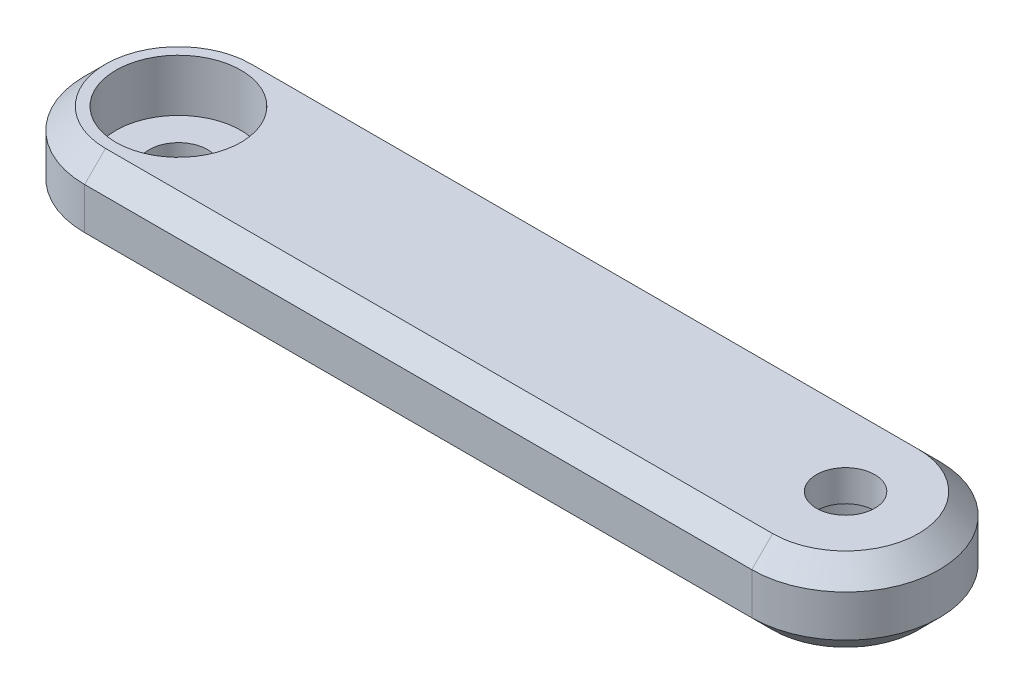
ISO-10303-21;
HEADER;
FILE_DESCRIPTION(('STEP AP214'),'2;1');
FILE_NAME('part.step','',(''),(''),'','','');
FILE_SCHEMA(('AUTOMOTIVE_DESIGN { 1 0 10303 214 1 1 1 1 }'));
ENDSEC;
DATA;
#1=APPLICATION_CONTEXT('core data for automotive mechanical design processes');
#2=APPLICATION_PROTOCOL_DEFINITION('international standard','automotive_design',2000,#1);
#3=PRODUCT_CONTEXT('',#1,'mechanical');
#4=PRODUCT('Part','Part','',(#3));
#5=PRODUCT_RELATED_PRODUCT_CATEGORY('part','',(#4));
#6=PRODUCT_DEFINITION_FORMATION('','',#4);
#7=PRODUCT_DEFINITION_CONTEXT('part definition',#1,'design');
#8=PRODUCT_DEFINITION('design','',#6,#7);
#9=PRODUCT_DEFINITION_SHAPE('','',#8);
#10=(LENGTH_UNIT() NAMED_UNIT(*) SI_UNIT(.MILLI.,.METRE.));
#11=(NAMED_UNIT(*) PLANE_ANGLE_UNIT() SI_UNIT($,.RADIAN.));
#12=(NAMED_UNIT(*) SI_UNIT($,.STERADIAN.) SOLID_ANGLE_UNIT());
#13=UNCERTAINTY_MEASURE_WITH_UNIT(LENGTH_MEASURE(1.E-05),#10,'distance_accuracy_value','');
#14=(GEOMETRIC_REPRESENTATION_CONTEXT(3) GLOBAL_UNCERTAINTY_ASSIGNED_CONTEXT((#13)) GLOBAL_UNIT_ASSIGNED_CONTEXT((#10,
#11,#12)) REPRESENTATION_CONTEXT('',''));
#15=CARTESIAN_POINT('',(0.,0.,0.));
#16=DIRECTION('',(0.,0.,1.));
#17=DIRECTION('',(1.,0.,0.));
#18=AXIS2_PLACEMENT_3D('',#15,#16,#17);
#19=CARTESIAN_POINT('',(-15.6632860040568,-6.,-1.3052738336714));
#20=DIRECTION('',(0.,1.,0.));
#21=DIRECTION('',(0.,0.,1.));
#22=AXIS2_PLACEMENT_3D('',#19,#20,#21);
#23=CYLINDRICAL_SURFACE('',#22,1.4);
#24=CARTESIAN_POINT('',(-15.6632860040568,0.,-1.3052738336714));
#25=DIRECTION('',(0.,1.,0.));
#26=DIRECTION('',(0.,0.,1.));
#27=AXIS2_PLACEMENT_3D('',#24,#25,#26);
#28=CIRCLE('',#27,1.4);
#29=CARTESIAN_POINT('',(-15.6632860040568,0.,0.0947261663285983));
#30=VERTEX_POINT('',#29);
#31=EDGE_CURVE('E171',#30,#30,#28,.T.);
#32=ORIENTED_EDGE('',*,*,#31,.F.);
#33=EDGE_LOOP('',(#32));
#34=FACE_BOUND('',#33,.T.);
#35=CARTESIAN_POINT('',(-15.6632860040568,1.5,-1.3052738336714));
#36=DIRECTION('',(0.,1.,0.));
#37=DIRECTION('',(0.,0.,1.));
#38=AXIS2_PLACEMENT_3D('',#35,#36,#37);
#39=CIRCLE('',#38,1.4);
#40=CARTESIAN_POINT('',(-15.6632860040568,1.5,0.0947261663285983));
#41=VERTEX_POINT('',#40);
#42=EDGE_CURVE('E48',#41,#41,#39,.F.);
#43=ORIENTED_EDGE('',*,*,#42,.F.);
#44=EDGE_LOOP('',(#43));
#45=FACE_BOUND('',#44,.T.);
#46=ADVANCED_FACE('F43',(#34,#45),#23,.F.);
#47=CARTESIAN_POINT('',(16.3367139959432,-6.,-1.3052738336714));
#48=DIRECTION('',(0.,1.,0.));
#49=DIRECTION('',(0.,0.,1.));
#50=AXIS2_PLACEMENT_3D('',#47,#48,#49);
#51=CYLINDRICAL_SURFACE('',#50,1.4);
#52=CARTESIAN_POINT('',(16.3367139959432,4.,-1.3052738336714));
#53=DIRECTION('',(0.,-1.,0.));
#54=DIRECTION('',(0.,0.,-1.));
#55=AXIS2_PLACEMENT_3D('',#52,#53,#54);
#56=CIRCLE('',#55,1.4);
#57=CARTESIAN_POINT('',(16.3367139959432,4.,-2.7052738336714));
#58=VERTEX_POINT('',#57);
#59=EDGE_CURVE('E139',#58,#58,#56,.T.);
#60=ORIENTED_EDGE('',*,*,#59,.F.);
#61=EDGE_LOOP('',(#60));
#62=FACE_BOUND('',#61,.T.);
#63=CARTESIAN_POINT('',(16.3367139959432,2.5,-1.3052738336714));
#64=DIRECTION('',(0.,-1.,0.));
#65=DIRECTION('',(0.,0.,-1.));
#66=AXIS2_PLACEMENT_3D('',#63,#64,#65);
#67=CIRCLE('',#66,1.4);
#68=CARTESIAN_POINT('',(16.3367139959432,2.5,-2.7052738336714));
#69=VERTEX_POINT('',#68);
#70=EDGE_CURVE('E147',#69,#69,#67,.T.);
#71=ORIENTED_EDGE('',*,*,#70,.T.);
#72=EDGE_LOOP('',(#71));
#73=FACE_BOUND('',#72,.T.);
#74=ADVANCED_FACE('F247',(#62,#73),#51,.F.);
#75=CARTESIAN_POINT('',(-15.6632860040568,4.,-1.3052738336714));
#76=DIRECTION('',(0.,1.,0.));
#77=DIRECTION('',(0.,0.,1.));
#78=AXIS2_PLACEMENT_3D('',#75,#76,#77);
#79=PLANE('',#78);
#80=CARTESIAN_POINT('',(-15.6632860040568,4.,-1.3052738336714));
#81=DIRECTION('',(0.,1.,0.));
#82=DIRECTION('',(0.,0.,1.));
#83=AXIS2_PLACEMENT_3D('',#80,#81,#82);
#84=CIRCLE('',#83,3.);
#85=CARTESIAN_POINT('',(-15.6632860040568,4.,1.6947261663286));
#86=VERTEX_POINT('',#85);
#87=EDGE_CURVE('E166',#86,#86,#84,.T.);
#88=ORIENTED_EDGE('',*,*,#87,.F.);
#89=EDGE_LOOP('',(#88));
#90=FACE_BOUND('',#89,.T.);
#91=DIRECTION('',(1.,0.,0.));
#92=VECTOR('',#91,1.);
#93=CARTESIAN_POINT('',(16.3367139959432,4.,2.19472616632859));
#94=LINE('',#93,#92);
#95=CARTESIAN_POINT('',(-15.6632860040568,4.,2.19472616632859));
#96=VERTEX_POINT('',#95);
#97=CARTESIAN_POINT('',(16.3367139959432,4.,2.19472616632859));
#98=VERTEX_POINT('',#97);
#99=EDGE_CURVE('E122',#96,#98,#94,.T.);
#100=ORIENTED_EDGE('',*,*,#99,.T.);
#101=CARTESIAN_POINT('',(16.3367139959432,4.,-1.3052738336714));
#102=DIRECTION('',(0.,1.,0.));
#103=DIRECTION('',(0.,0.,1.));
#104=AXIS2_PLACEMENT_3D('',#101,#102,#103);
#105=CIRCLE('',#104,3.5);
#106=CARTESIAN_POINT('',(16.3367139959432,4.,-4.8052738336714));
#107=VERTEX_POINT('',#106);
#108=EDGE_CURVE('E118',#98,#107,#105,.T.);
#109=ORIENTED_EDGE('',*,*,#108,.T.);
#110=DIRECTION('',(-1.,0.,0.));
#111=VECTOR('',#110,1.);
#112=CARTESIAN_POINT('',(-15.6632860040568,4.,-4.8052738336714));
#113=LINE('',#112,#111);
#114=CARTESIAN_POINT('',(-15.6632860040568,4.,-4.8052738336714));
#115=VERTEX_POINT('',#114);
#116=EDGE_CURVE('E111',#107,#115,#113,.T.);
#117=ORIENTED_EDGE('',*,*,#116,.T.);
#118=CARTESIAN_POINT('',(-15.6632860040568,4.,-1.3052738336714));
#119=DIRECTION('',(0.,1.,0.));
#120=DIRECTION('',(0.,0.,1.));
#121=AXIS2_PLACEMENT_3D('',#118,#119,#120);
#122=CIRCLE('',#121,3.5);
#123=EDGE_CURVE('E115',#115,#96,#122,.T.);
#124=ORIENTED_EDGE('',*,*,#123,.T.);
#125=EDGE_LOOP('',(#100,#109,#117,#124));
#126=FACE_BOUND('',#125,.T.);
#127=ORIENTED_EDGE('',*,*,#59,.T.);
#128=EDGE_LOOP('',(#127));
#129=FACE_BOUND('',#128,.T.);
#130=ADVANCED_FACE('F113',(#90,#126,#129),#79,.T.);
#131=CARTESIAN_POINT('',(-15.6632860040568,0.,-1.3052738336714));
#132=DIRECTION('',(0.,1.,0.));
#133=DIRECTION('',(0.,0.,1.));
#134=AXIS2_PLACEMENT_3D('',#131,#132,#133);
#135=PLANE('',#134);
#136=CARTESIAN_POINT('',(16.3367139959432,0.,-1.3052738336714));
#137=DIRECTION('',(0.,-1.,0.));
#138=DIRECTION('',(0.,0.,-1.));
#139=AXIS2_PLACEMENT_3D('',#136,#137,#138);
#140=CIRCLE('',#139,3.);
#141=CARTESIAN_POINT('',(16.3367139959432,0.,-4.30527383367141));
#142=VERTEX_POINT('',#141);
#143=EDGE_CURVE('E159',#142,#142,#140,.T.);
#144=ORIENTED_EDGE('',*,*,#143,.F.);
#145=EDGE_LOOP('',(#144));
#146=FACE_BOUND('',#145,.T.);
#147=DIRECTION('',(1.,0.,0.));
#148=VECTOR('',#147,1.);
#149=CARTESIAN_POINT('',(-15.6632860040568,0.,-4.80527383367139));
#150=LINE('',#149,#148);
#151=CARTESIAN_POINT('',(-15.6632860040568,0.,-4.80527383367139));
#152=VERTEX_POINT('',#151);
#153=CARTESIAN_POINT('',(16.3367139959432,0.,-4.80527383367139));
#154=VERTEX_POINT('',#153);
#155=EDGE_CURVE('E204',#152,#154,#150,.T.);
#156=ORIENTED_EDGE('',*,*,#155,.T.);
#157=CARTESIAN_POINT('',(16.3367139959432,0.,-1.3052738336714));
#158=DIRECTION('',(0.,1.,0.));
#159=DIRECTION('',(0.,0.,1.));
#160=AXIS2_PLACEMENT_3D('',#157,#158,#159);
#161=CIRCLE('',#160,3.49999999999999);
#162=CARTESIAN_POINT('',(16.3367139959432,0.,2.19472616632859));
#163=VERTEX_POINT('',#162);
#164=EDGE_CURVE('E11',#154,#163,#161,.F.);
#165=ORIENTED_EDGE('',*,*,#164,.T.);
#166=DIRECTION('',(-1.,0.,0.));
#167=VECTOR('',#166,1.);
#168=CARTESIAN_POINT('',(-15.6632860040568,0.,2.19472616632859));
#169=LINE('',#168,#167);
#170=CARTESIAN_POINT('',(-15.6632860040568,0.,2.19472616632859));
#171=VERTEX_POINT('',#170);
#172=EDGE_CURVE('E53',#163,#171,#169,.T.);
#173=ORIENTED_EDGE('',*,*,#172,.T.);
#174=CARTESIAN_POINT('',(-15.6632860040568,0.,-1.3052738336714));
#175=DIRECTION('',(0.,1.,0.));
#176=DIRECTION('',(0.,0.,1.));
#177=AXIS2_PLACEMENT_3D('',#174,#175,#176);
#178=CIRCLE('',#177,3.49999999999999);
#179=EDGE_CURVE('E206',#171,#152,#178,.F.);
#180=ORIENTED_EDGE('',*,*,#179,.T.);
#181=EDGE_LOOP('',(#156,#165,#173,#180));
#182=FACE_BOUND('',#181,.T.);
#183=ORIENTED_EDGE('',*,*,#31,.T.);
#184=EDGE_LOOP('',(#183));
#185=FACE_BOUND('',#184,.T.);
#186=ADVANCED_FACE('F238',(#146,#182,#185),#135,.F.);
#187=CARTESIAN_POINT('',(-15.6632860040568,4.,-1.3052738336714));
#188=DIRECTION('',(0.,-1.,0.));
#189=DIRECTION('',(0.,0.,-1.));
#190=AXIS2_PLACEMENT_3D('',#187,#188,#189);
#191=CYLINDRICAL_SURFACE('',#190,4.5);
#192=DIRECTION('',(0.,-1.,0.));
#193=VECTOR('',#192,1.);
#194=CARTESIAN_POINT('',(-15.6632860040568,4.,3.1947261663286));
#195=LINE('',#194,#193);
#196=CARTESIAN_POINT('',(-15.6632860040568,2.99999999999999,3.1947261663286));
#197=VERTEX_POINT('',#196);
#198=CARTESIAN_POINT('',(-15.6632860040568,1.,3.1947261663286));
#199=VERTEX_POINT('',#198);
#200=EDGE_CURVE('E133',#197,#199,#195,.T.);
#201=ORIENTED_EDGE('',*,*,#200,.F.);
#202=CARTESIAN_POINT('',(-15.6632860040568,2.99999999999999,-1.3052738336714));
#203=DIRECTION('',(0.,1.,0.));
#204=DIRECTION('',(0.,0.,1.));
#205=AXIS2_PLACEMENT_3D('',#202,#203,#204);
#206=CIRCLE('',#205,4.5);
#207=CARTESIAN_POINT('',(-15.6632860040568,2.99999999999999,-5.8052738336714));
#208=VERTEX_POINT('',#207);
#209=EDGE_CURVE('E202',#197,#208,#206,.F.);
#210=ORIENTED_EDGE('',*,*,#209,.T.);
#211=DIRECTION('',(0.,-1.,0.));
#212=VECTOR('',#211,1.);
#213=CARTESIAN_POINT('',(-15.6632860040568,4.,-5.8052738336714));
#214=LINE('',#213,#212);
#215=CARTESIAN_POINT('',(-15.6632860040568,1.,-5.8052738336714));
#216=VERTEX_POINT('',#215);
#217=EDGE_CURVE('E172',#208,#216,#214,.T.);
#218=ORIENTED_EDGE('',*,*,#217,.T.);
#219=CARTESIAN_POINT('',(-15.6632860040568,1.,-1.3052738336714));
#220=DIRECTION('',(0.,1.,0.));
#221=DIRECTION('',(0.,0.,1.));
#222=AXIS2_PLACEMENT_3D('',#219,#220,#221);
#223=CIRCLE('',#222,4.5);
#224=EDGE_CURVE('E200',#216,#199,#223,.T.);
#225=ORIENTED_EDGE('',*,*,#224,.T.);
#226=EDGE_LOOP('',(#201,#210,#218,#225));
#227=FACE_BOUND('',#226,.T.);
#228=ADVANCED_FACE('F232',(#227),#191,.T.);
#229=CARTESIAN_POINT('',(11.3367139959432,4.,3.1947261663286));
#230=DIRECTION('',(0.,0.,-1.));
#231=DIRECTION('',(-1.,0.,0.));
#232=AXIS2_PLACEMENT_3D('',#229,#230,#231);
#233=PLANE('',#232);
#234=DIRECTION('',(0.,-1.,0.));
#235=VECTOR('',#234,1.);
#236=CARTESIAN_POINT('',(16.3367139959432,4.,3.1947261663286));
#237=LINE('',#236,#235);
#238=CARTESIAN_POINT('',(16.3367139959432,2.99999999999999,3.1947261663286));
#239=VERTEX_POINT('',#238);
#240=CARTESIAN_POINT('',(16.3367139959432,1.,3.1947261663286));
#241=VERTEX_POINT('',#240);
#242=EDGE_CURVE('E178',#239,#241,#237,.T.);
#243=ORIENTED_EDGE('',*,*,#242,.F.);
#244=DIRECTION('',(-1.,0.,0.));
#245=VECTOR('',#244,1.);
#246=CARTESIAN_POINT('',(-15.6632860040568,2.99999999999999,3.1947261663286));
#247=LINE('',#246,#245);
#248=EDGE_CURVE('E195',#239,#197,#247,.T.);
#249=ORIENTED_EDGE('',*,*,#248,.T.);
#250=ORIENTED_EDGE('',*,*,#200,.T.);
#251=DIRECTION('',(1.,0.,0.));
#252=VECTOR('',#251,1.);
#253=CARTESIAN_POINT('',(11.3367139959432,1.,3.1947261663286));
#254=LINE('',#253,#252);
#255=EDGE_CURVE('E193',#199,#241,#254,.T.);
#256=ORIENTED_EDGE('',*,*,#255,.T.);
#257=EDGE_LOOP('',(#243,#249,#250,#256));
#258=FACE_BOUND('',#257,.T.);
#259=ADVANCED_FACE('F218',(#258),#233,.F.);
#260=CARTESIAN_POINT('',(16.3367139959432,4.,-1.3052738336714));
#261=DIRECTION('',(0.,-1.,0.));
#262=DIRECTION('',(0.,0.,-1.));
#263=AXIS2_PLACEMENT_3D('',#260,#261,#262);
#264=CYLINDRICAL_SURFACE('',#263,4.5);
#265=DIRECTION('',(0.,-1.,0.));
#266=VECTOR('',#265,1.);
#267=CARTESIAN_POINT('',(16.3367139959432,4.,-5.8052738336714));
#268=LINE('',#267,#266);
#269=CARTESIAN_POINT('',(16.3367139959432,2.99999999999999,-5.8052738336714));
#270=VERTEX_POINT('',#269);
#271=CARTESIAN_POINT('',(16.3367139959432,1.,-5.8052738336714));
#272=VERTEX_POINT('',#271);
#273=EDGE_CURVE('E175',#270,#272,#268,.T.);
#274=ORIENTED_EDGE('',*,*,#273,.F.);
#275=CARTESIAN_POINT('',(16.3367139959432,2.99999999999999,-1.3052738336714));
#276=DIRECTION('',(0.,1.,0.));
#277=DIRECTION('',(0.,0.,1.));
#278=AXIS2_PLACEMENT_3D('',#275,#276,#277);
#279=CIRCLE('',#278,4.5);
#280=EDGE_CURVE('E190',#270,#239,#279,.F.);
#281=ORIENTED_EDGE('',*,*,#280,.T.);
#282=ORIENTED_EDGE('',*,*,#242,.T.);
#283=CARTESIAN_POINT('',(16.3367139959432,1.,-1.3052738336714));
#284=DIRECTION('',(0.,1.,0.));
#285=DIRECTION('',(0.,0.,1.));
#286=AXIS2_PLACEMENT_3D('',#283,#284,#285);
#287=CIRCLE('',#286,4.5);
#288=EDGE_CURVE('E187',#241,#272,#287,.T.);
#289=ORIENTED_EDGE('',*,*,#288,.T.);
#290=EDGE_LOOP('',(#274,#281,#282,#289));
#291=FACE_BOUND('',#290,.T.);
#292=ADVANCED_FACE('F216',(#291),#264,.T.);
#293=CARTESIAN_POINT('',(-15.6632860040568,4.,-5.8052738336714));
#294=DIRECTION('',(0.,0.,1.));
#295=DIRECTION('',(1.,0.,0.));
#296=AXIS2_PLACEMENT_3D('',#293,#294,#295);
#297=PLANE('',#296);
#298=ORIENTED_EDGE('',*,*,#217,.F.);
#299=DIRECTION('',(1.,0.,0.));
#300=VECTOR('',#299,1.);
#301=CARTESIAN_POINT('',(16.3367139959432,2.99999999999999,-5.8052738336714));
#302=LINE('',#301,#300);
#303=EDGE_CURVE('E136',#208,#270,#302,.T.);
#304=ORIENTED_EDGE('',*,*,#303,.T.);
#305=ORIENTED_EDGE('',*,*,#273,.T.);
#306=DIRECTION('',(-1.,0.,0.));
#307=VECTOR('',#306,1.);
#308=CARTESIAN_POINT('',(-15.6632860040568,1.,-5.8052738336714));
#309=LINE('',#308,#307);
#310=EDGE_CURVE('E197',#272,#216,#309,.T.);
#311=ORIENTED_EDGE('',*,*,#310,.T.);
#312=EDGE_LOOP('',(#298,#304,#305,#311));
#313=FACE_BOUND('',#312,.T.);
#314=ADVANCED_FACE('F229',(#313),#297,.F.);
#315=CARTESIAN_POINT('',(-15.6632860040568,4.,-1.3052738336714));
#316=DIRECTION('',(0.,-1.,0.));
#317=DIRECTION('',(0.,0.,-1.));
#318=AXIS2_PLACEMENT_3D('',#315,#316,#317);
#319=CONICAL_SURFACE('',#318,3.5,0.785398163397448);
#320=DIRECTION('',(0.,0.707106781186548,0.707106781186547));
#321=VECTOR('',#320,1.);
#322=CARTESIAN_POINT('',(-15.6632860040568,2.99999999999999,-5.8052738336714));
#323=LINE('',#322,#321);
#324=EDGE_CURVE('E128',#208,#115,#323,.T.);
#325=ORIENTED_EDGE('',*,*,#324,.F.);
#326=ORIENTED_EDGE('',*,*,#209,.F.);
#327=DIRECTION('',(0.,-0.707106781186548,0.707106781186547));
#328=VECTOR('',#327,1.);
#329=CARTESIAN_POINT('',(-15.6632860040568,4.,2.19472616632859));
#330=LINE('',#329,#328);
#331=EDGE_CURVE('E131',#96,#197,#330,.T.);
#332=ORIENTED_EDGE('',*,*,#331,.F.);
#333=ORIENTED_EDGE('',*,*,#123,.F.);
#334=EDGE_LOOP('',(#325,#326,#332,#333));
#335=FACE_BOUND('',#334,.T.);
#336=ADVANCED_FACE('F126',(#335),#319,.T.);
#337=CARTESIAN_POINT('',(-15.6632860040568,4.,2.19472616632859));
#338=DIRECTION('',(0.,0.707106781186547,0.707106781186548));
#339=DIRECTION('',(-1.,0.,0.));
#340=AXIS2_PLACEMENT_3D('',#337,#338,#339);
#341=PLANE('',#340);
#342=ORIENTED_EDGE('',*,*,#331,.T.);
#343=ORIENTED_EDGE('',*,*,#248,.F.);
#344=DIRECTION('',(0.,-0.707106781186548,0.707106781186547));
#345=VECTOR('',#344,1.);
#346=CARTESIAN_POINT('',(16.3367139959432,4.,2.19472616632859));
#347=LINE('',#346,#345);
#348=EDGE_CURVE('E137',#98,#239,#347,.T.);
#349=ORIENTED_EDGE('',*,*,#348,.F.);
#350=ORIENTED_EDGE('',*,*,#99,.F.);
#351=EDGE_LOOP('',(#342,#343,#349,#350));
#352=FACE_BOUND('',#351,.T.);
#353=ADVANCED_FACE('F289',(#352),#341,.T.);
#354=CARTESIAN_POINT('',(-15.6632860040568,4.,-4.8052738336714));
#355=DIRECTION('',(0.,0.707106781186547,-0.707106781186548));
#356=DIRECTION('',(1.,0.,0.));
#357=AXIS2_PLACEMENT_3D('',#354,#355,#356);
#358=PLANE('',#357);
#359=ORIENTED_EDGE('',*,*,#324,.T.);
#360=ORIENTED_EDGE('',*,*,#116,.F.);
#361=DIRECTION('',(0.,0.707106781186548,0.707106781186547));
#362=VECTOR('',#361,1.);
#363=CARTESIAN_POINT('',(16.3367139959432,2.99999999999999,-5.8052738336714));
#364=LINE('',#363,#362);
#365=EDGE_CURVE('E141',#270,#107,#364,.T.);
#366=ORIENTED_EDGE('',*,*,#365,.F.);
#367=ORIENTED_EDGE('',*,*,#303,.F.);
#368=EDGE_LOOP('',(#359,#360,#366,#367));
#369=FACE_BOUND('',#368,.T.);
#370=ADVANCED_FACE('F135',(#369),#358,.T.);
#371=CARTESIAN_POINT('',(16.3367139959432,4.,-1.3052738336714));
#372=DIRECTION('',(0.,-1.,0.));
#373=DIRECTION('',(0.,0.,-1.));
#374=AXIS2_PLACEMENT_3D('',#371,#372,#373);
#375=CONICAL_SURFACE('',#374,3.5,0.785398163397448);
#376=ORIENTED_EDGE('',*,*,#348,.T.);
#377=ORIENTED_EDGE('',*,*,#280,.F.);
#378=ORIENTED_EDGE('',*,*,#365,.T.);
#379=ORIENTED_EDGE('',*,*,#108,.F.);
#380=EDGE_LOOP('',(#376,#377,#378,#379));
#381=FACE_BOUND('',#380,.T.);
#382=ADVANCED_FACE('F210',(#381),#375,.T.);
#383=CARTESIAN_POINT('',(-15.6632860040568,1.,-1.3052738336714));
#384=DIRECTION('',(0.,1.,0.));
#385=DIRECTION('',(0.,0.,1.));
#386=AXIS2_PLACEMENT_3D('',#383,#384,#385);
#387=CONICAL_SURFACE('',#386,4.5,0.78539816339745);
#388=DIRECTION('',(0.,0.707106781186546,-0.707106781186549));
#389=VECTOR('',#388,1.);
#390=CARTESIAN_POINT('',(-15.6632860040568,0.,-4.80527383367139));
#391=LINE('',#390,#389);
#392=EDGE_CURVE('E149',#152,#216,#391,.T.);
#393=ORIENTED_EDGE('',*,*,#392,.F.);
#394=ORIENTED_EDGE('',*,*,#179,.F.);
#395=DIRECTION('',(0.,-0.707106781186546,-0.707106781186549));
#396=VECTOR('',#395,1.);
#397=CARTESIAN_POINT('',(-15.6632860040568,1.,3.1947261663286));
#398=LINE('',#397,#396);
#399=EDGE_CURVE('E152',#199,#171,#398,.T.);
#400=ORIENTED_EDGE('',*,*,#399,.F.);
#401=ORIENTED_EDGE('',*,*,#224,.F.);
#402=EDGE_LOOP('',(#393,#394,#400,#401));
#403=FACE_BOUND('',#402,.T.);
#404=ADVANCED_FACE('F46',(#403),#387,.T.);
#405=CARTESIAN_POINT('',(11.3367139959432,1.,3.1947261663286));
#406=DIRECTION('',(0.,0.707106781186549,-0.707106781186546));
#407=DIRECTION('',(1.,0.,0.));
#408=AXIS2_PLACEMENT_3D('',#405,#406,#407);
#409=PLANE('',#408);
#410=ORIENTED_EDGE('',*,*,#399,.T.);
#411=ORIENTED_EDGE('',*,*,#172,.F.);
#412=DIRECTION('',(0.,-0.707106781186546,-0.707106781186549));
#413=VECTOR('',#412,1.);
#414=CARTESIAN_POINT('',(16.3367139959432,1.,3.1947261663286));
#415=LINE('',#414,#413);
#416=EDGE_CURVE('E61',#241,#163,#415,.T.);
#417=ORIENTED_EDGE('',*,*,#416,.F.);
#418=ORIENTED_EDGE('',*,*,#255,.F.);
#419=EDGE_LOOP('',(#410,#411,#417,#418));
#420=FACE_BOUND('',#419,.T.);
#421=ADVANCED_FACE('F223',(#420),#409,.F.);
#422=CARTESIAN_POINT('',(-15.6632860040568,1.,-5.8052738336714));
#423=DIRECTION('',(0.,0.707106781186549,0.707106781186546));
#424=DIRECTION('',(-1.,0.,0.));
#425=AXIS2_PLACEMENT_3D('',#422,#423,#424);
#426=PLANE('',#425);
#427=ORIENTED_EDGE('',*,*,#392,.T.);
#428=ORIENTED_EDGE('',*,*,#310,.F.);
#429=DIRECTION('',(0.,0.707106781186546,-0.707106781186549));
#430=VECTOR('',#429,1.);
#431=CARTESIAN_POINT('',(16.3367139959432,0.,-4.80527383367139));
#432=LINE('',#431,#430);
#433=EDGE_CURVE('E145',#154,#272,#432,.T.);
#434=ORIENTED_EDGE('',*,*,#433,.F.);
#435=ORIENTED_EDGE('',*,*,#155,.F.);
#436=EDGE_LOOP('',(#427,#428,#434,#435));
#437=FACE_BOUND('',#436,.T.);
#438=ADVANCED_FACE('F237',(#437),#426,.F.);
#439=CARTESIAN_POINT('',(16.3367139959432,1.,-1.3052738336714));
#440=DIRECTION('',(0.,1.,0.));
#441=DIRECTION('',(0.,0.,1.));
#442=AXIS2_PLACEMENT_3D('',#439,#440,#441);
#443=CONICAL_SURFACE('',#442,4.5,0.78539816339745);
#444=ORIENTED_EDGE('',*,*,#416,.T.);
#445=ORIENTED_EDGE('',*,*,#164,.F.);
#446=ORIENTED_EDGE('',*,*,#433,.T.);
#447=ORIENTED_EDGE('',*,*,#288,.F.);
#448=EDGE_LOOP('',(#444,#445,#446,#447));
#449=FACE_BOUND('',#448,.T.);
#450=ADVANCED_FACE('F224',(#449),#443,.T.);
#451=CARTESIAN_POINT('',(16.3367139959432,2.5,-1.3052738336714));
#452=DIRECTION('',(0.,-1.,0.));
#453=DIRECTION('',(0.,0.,-1.));
#454=AXIS2_PLACEMENT_3D('',#451,#452,#453);
#455=CYLINDRICAL_SURFACE('',#454,3.);
#456=CARTESIAN_POINT('',(16.3367139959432,2.5,-1.3052738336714));
#457=DIRECTION('',(0.,-1.,0.));
#458=DIRECTION('',(0.,0.,-1.));
#459=AXIS2_PLACEMENT_3D('',#456,#457,#458);
#460=CIRCLE('',#459,3.);
#461=CARTESIAN_POINT('',(16.3367139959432,2.5,-4.30527383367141));
#462=VERTEX_POINT('',#461);
#463=EDGE_CURVE('E155',#462,#462,#460,.T.);
#464=ORIENTED_EDGE('',*,*,#463,.F.);
#465=EDGE_LOOP('',(#464));
#466=FACE_BOUND('',#465,.T.);
#467=ORIENTED_EDGE('',*,*,#143,.T.);
#468=EDGE_LOOP('',(#467));
#469=FACE_BOUND('',#468,.T.);
#470=ADVANCED_FACE('F306',(#466,#469),#455,.F.);
#471=CARTESIAN_POINT('',(16.3367139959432,2.5,-1.3052738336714));
#472=DIRECTION('',(0.,-1.,0.));
#473=DIRECTION('',(0.,0.,-1.));
#474=AXIS2_PLACEMENT_3D('',#471,#472,#473);
#475=PLANE('',#474);
#476=ORIENTED_EDGE('',*,*,#70,.F.);
#477=EDGE_LOOP('',(#476));
#478=FACE_BOUND('',#477,.T.);
#479=ORIENTED_EDGE('',*,*,#463,.T.);
#480=EDGE_LOOP('',(#479));
#481=FACE_BOUND('',#480,.T.);
#482=ADVANCED_FACE('F412',(#478,#481),#475,.T.);
#483=CARTESIAN_POINT('',(-15.6632860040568,1.5,-1.3052738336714));
#484=DIRECTION('',(0.,1.,0.));
#485=DIRECTION('',(0.,0.,1.));
#486=AXIS2_PLACEMENT_3D('',#483,#484,#485);
#487=PLANE('',#486);
#488=CARTESIAN_POINT('',(-15.6632860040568,1.5,-1.3052738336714));
#489=DIRECTION('',(0.,1.,0.));
#490=DIRECTION('',(0.,0.,1.));
#491=AXIS2_PLACEMENT_3D('',#488,#489,#490);
#492=CIRCLE('',#491,3.);
#493=CARTESIAN_POINT('',(-15.6632860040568,1.5,1.6947261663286));
#494=VERTEX_POINT('',#493);
#495=EDGE_CURVE('E252',#494,#494,#492,.T.);
#496=ORIENTED_EDGE('',*,*,#495,.T.);
#497=EDGE_LOOP('',(#496));
#498=FACE_BOUND('',#497,.T.);
#499=ORIENTED_EDGE('',*,*,#42,.T.);
#500=EDGE_LOOP('',(#499));
#501=FACE_BOUND('',#500,.T.);
#502=ADVANCED_FACE('F421',(#498,#501),#487,.T.);
#503=CARTESIAN_POINT('',(-15.6632860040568,1.5,-1.3052738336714));
#504=DIRECTION('',(0.,1.,0.));
#505=DIRECTION('',(0.,0.,1.));
#506=AXIS2_PLACEMENT_3D('',#503,#504,#505);
#507=CYLINDRICAL_SURFACE('',#506,3.);
#508=ORIENTED_EDGE('',*,*,#495,.F.);
#509=EDGE_LOOP('',(#508));
#510=FACE_BOUND('',#509,.T.);
#511=ORIENTED_EDGE('',*,*,#87,.T.);
#512=EDGE_LOOP('',(#511));
#513=FACE_BOUND('',#512,.T.);
#514=ADVANCED_FACE('F259',(#510,#513),#507,.F.);
#515=CLOSED_SHELL('',(#46,#74,#130,#186,#228,#259,#292,#314,#336,#353,#370,#382,#404,#421,#438,
#450,#470,#482,#502,#514));
#516=MANIFOLD_SOLID_BREP('B2',#515);
#517=ADVANCED_BREP_SHAPE_REPRESENTATION('',(#18,#516),#14);
#518=SHAPE_DEFINITION_REPRESENTATION(#9,#517);
ENDSEC;
END-ISO-10303-21;
